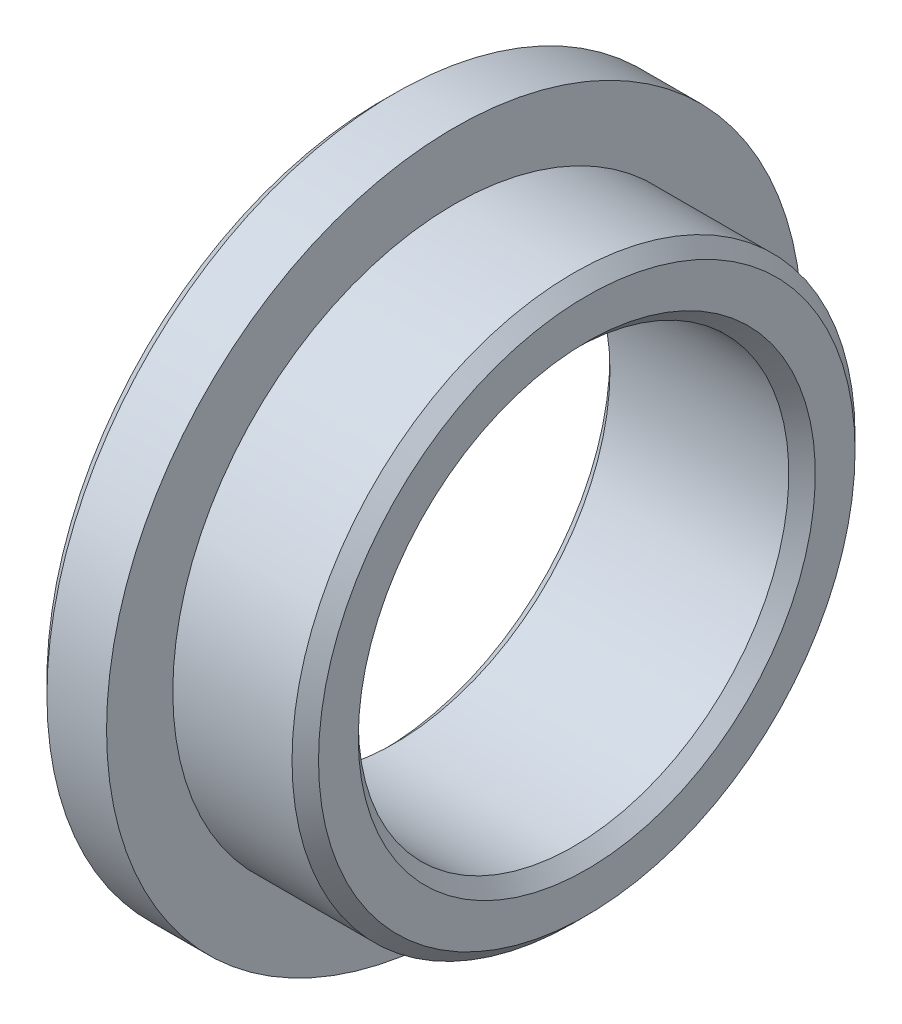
ISO-10303-21;
HEADER;
FILE_DESCRIPTION(('STEP AP214'),'2;1');
FILE_NAME('part.step','',(''),(''),'','','');
FILE_SCHEMA(('AUTOMOTIVE_DESIGN { 1 0 10303 214 1 1 1 1 }'));
ENDSEC;
DATA;
#1=APPLICATION_CONTEXT('core data for automotive mechanical design processes');
#2=APPLICATION_PROTOCOL_DEFINITION('international standard','automotive_design',2000,#1);
#3=PRODUCT_CONTEXT('',#1,'mechanical');
#4=PRODUCT('Part','Part','',(#3));
#5=PRODUCT_RELATED_PRODUCT_CATEGORY('part','',(#4));
#6=PRODUCT_DEFINITION_FORMATION('','',#4);
#7=PRODUCT_DEFINITION_CONTEXT('part definition',#1,'design');
#8=PRODUCT_DEFINITION('design','',#6,#7);
#9=PRODUCT_DEFINITION_SHAPE('','',#8);
#10=(LENGTH_UNIT() NAMED_UNIT(*) SI_UNIT(.MILLI.,.METRE.));
#11=(NAMED_UNIT(*) PLANE_ANGLE_UNIT() SI_UNIT($,.RADIAN.));
#12=(NAMED_UNIT(*) SI_UNIT($,.STERADIAN.) SOLID_ANGLE_UNIT());
#13=UNCERTAINTY_MEASURE_WITH_UNIT(LENGTH_MEASURE(1.E-05),#10,'distance_accuracy_value','');
#14=(GEOMETRIC_REPRESENTATION_CONTEXT(3) GLOBAL_UNCERTAINTY_ASSIGNED_CONTEXT((#13)) GLOBAL_UNIT_ASSIGNED_CONTEXT((#10,
#11,#12)) REPRESENTATION_CONTEXT('',''));
#15=CARTESIAN_POINT('',(0.,0.,0.));
#16=DIRECTION('',(0.,0.,1.));
#17=DIRECTION('',(1.,0.,0.));
#18=AXIS2_PLACEMENT_3D('',#15,#16,#17);
#19=CARTESIAN_POINT('',(0.,42.5,0.));
#20=DIRECTION('',(-1.,0.,0.));
#21=DIRECTION('',(0.,0.,1.));
#22=AXIS2_PLACEMENT_3D('',#19,#20,#21);
#23=PLANE('',#22);
#24=CARTESIAN_POINT('',(0.,0.,0.));
#25=DIRECTION('',(-1.,0.,0.));
#26=DIRECTION('',(0.,0.,1.));
#27=AXIS2_PLACEMENT_3D('',#24,#25,#26);
#28=CIRCLE('',#27,52.5);
#29=CARTESIAN_POINT('',(0.,0.,52.5));
#30=VERTEX_POINT('',#29);
#31=EDGE_CURVE('E63',#30,#30,#28,.T.);
#32=ORIENTED_EDGE('',*,*,#31,.F.);
#33=EDGE_LOOP('',(#32));
#34=FACE_BOUND('',#33,.T.);
#35=CARTESIAN_POINT('',(0.,0.,0.));
#36=DIRECTION('',(-1.,0.,0.));
#37=DIRECTION('',(0.,0.,1.));
#38=AXIS2_PLACEMENT_3D('',#35,#36,#37);
#39=CIRCLE('',#38,42.5);
#40=CARTESIAN_POINT('',(0.,0.,42.5));
#41=VERTEX_POINT('',#40);
#42=EDGE_CURVE('E60',#41,#41,#39,.T.);
#43=ORIENTED_EDGE('',*,*,#42,.T.);
#44=EDGE_LOOP('',(#43));
#45=FACE_BOUND('',#44,.T.);
#46=ADVANCED_FACE('F29',(#34,#45),#23,.F.);
#47=CARTESIAN_POINT('',(-17.7396825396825,0.,0.));
#48=DIRECTION('',(-1.,0.,0.));
#49=DIRECTION('',(0.,0.,1.));
#50=AXIS2_PLACEMENT_3D('',#47,#48,#49);
#51=CYLINDRICAL_SURFACE('',#50,42.5);
#52=CARTESIAN_POINT('',(18.,0.,0.));
#53=DIRECTION('',(-1.,0.,0.));
#54=DIRECTION('',(0.,0.,1.));
#55=AXIS2_PLACEMENT_3D('',#52,#53,#54);
#56=CIRCLE('',#55,42.5);
#57=CARTESIAN_POINT('',(18.,0.,42.5));
#58=VERTEX_POINT('',#57);
#59=EDGE_CURVE('E35',#58,#58,#56,.T.);
#60=ORIENTED_EDGE('',*,*,#59,.T.);
#61=EDGE_LOOP('',(#60));
#62=FACE_BOUND('',#61,.T.);
#63=ORIENTED_EDGE('',*,*,#42,.F.);
#64=EDGE_LOOP('',(#63));
#65=FACE_BOUND('',#64,.T.);
#66=ADVANCED_FACE('F71',(#62,#65),#51,.T.);
#67=CARTESIAN_POINT('',(20.,42.5,0.));
#68=DIRECTION('',(-1.,0.,0.));
#69=DIRECTION('',(0.,0.,1.));
#70=AXIS2_PLACEMENT_3D('',#67,#68,#69);
#71=PLANE('',#70);
#72=CARTESIAN_POINT('',(20.,0.,0.));
#73=DIRECTION('',(-1.,0.,0.));
#74=DIRECTION('',(0.,0.,1.));
#75=AXIS2_PLACEMENT_3D('',#72,#73,#74);
#76=CIRCLE('',#75,34.5);
#77=CARTESIAN_POINT('',(20.,0.,34.5));
#78=VERTEX_POINT('',#77);
#79=EDGE_CURVE('E54',#78,#78,#76,.T.);
#80=ORIENTED_EDGE('',*,*,#79,.T.);
#81=EDGE_LOOP('',(#80));
#82=FACE_BOUND('',#81,.T.);
#83=CARTESIAN_POINT('',(20.,0.,0.));
#84=DIRECTION('',(-1.,0.,0.));
#85=DIRECTION('',(0.,0.,1.));
#86=AXIS2_PLACEMENT_3D('',#83,#84,#85);
#87=CIRCLE('',#86,40.5);
#88=CARTESIAN_POINT('',(20.,0.,40.5));
#89=VERTEX_POINT('',#88);
#90=EDGE_CURVE('E57',#89,#89,#87,.F.);
#91=ORIENTED_EDGE('',*,*,#90,.T.);
#92=EDGE_LOOP('',(#91));
#93=FACE_BOUND('',#92,.T.);
#94=ADVANCED_FACE('F75',(#82,#93),#71,.F.);
#95=CARTESIAN_POINT('',(-17.7396825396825,0.,0.));
#96=DIRECTION('',(-1.,0.,0.));
#97=DIRECTION('',(0.,0.,1.));
#98=AXIS2_PLACEMENT_3D('',#95,#96,#97);
#99=CYLINDRICAL_SURFACE('',#98,32.5);
#100=CARTESIAN_POINT('',(18.,0.,0.));
#101=DIRECTION('',(-1.,0.,0.));
#102=DIRECTION('',(0.,0.,1.));
#103=AXIS2_PLACEMENT_3D('',#100,#101,#102);
#104=CIRCLE('',#103,32.5);
#105=CARTESIAN_POINT('',(18.,0.,32.5));
#106=VERTEX_POINT('',#105);
#107=EDGE_CURVE('E48',#106,#106,#104,.F.);
#108=ORIENTED_EDGE('',*,*,#107,.T.);
#109=EDGE_LOOP('',(#108));
#110=FACE_BOUND('',#109,.T.);
#111=CARTESIAN_POINT('',(-8.99999999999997,0.,0.));
#112=DIRECTION('',(1.,0.,0.));
#113=DIRECTION('',(0.,0.,-1.));
#114=AXIS2_PLACEMENT_3D('',#111,#112,#113);
#115=CIRCLE('',#114,32.5);
#116=CARTESIAN_POINT('',(-8.99999999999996,0.,-32.5));
#117=VERTEX_POINT('',#116);
#118=EDGE_CURVE('E51',#117,#117,#115,.F.);
#119=ORIENTED_EDGE('',*,*,#118,.T.);
#120=EDGE_LOOP('',(#119));
#121=FACE_BOUND('',#120,.T.);
#122=ADVANCED_FACE('F79',(#110,#121),#99,.F.);
#123=CARTESIAN_POINT('',(-11.,52.5,0.));
#124=DIRECTION('',(1.,0.,0.));
#125=DIRECTION('',(0.,0.,-1.));
#126=AXIS2_PLACEMENT_3D('',#123,#124,#125);
#127=PLANE('',#126);
#128=CARTESIAN_POINT('',(-11.,0.,0.));
#129=DIRECTION('',(1.,0.,0.));
#130=DIRECTION('',(0.,0.,-1.));
#131=AXIS2_PLACEMENT_3D('',#128,#129,#130);
#132=CIRCLE('',#131,34.5);
#133=CARTESIAN_POINT('',(-11.,0.,-34.5));
#134=VERTEX_POINT('',#133);
#135=EDGE_CURVE('E39',#134,#134,#132,.T.);
#136=ORIENTED_EDGE('',*,*,#135,.T.);
#137=EDGE_LOOP('',(#136));
#138=FACE_BOUND('',#137,.T.);
#139=CARTESIAN_POINT('',(-11.,0.,0.));
#140=DIRECTION('',(1.,0.,0.));
#141=DIRECTION('',(0.,0.,-1.));
#142=AXIS2_PLACEMENT_3D('',#139,#140,#141);
#143=CIRCLE('',#142,50.5);
#144=CARTESIAN_POINT('',(-11.,0.,-50.5));
#145=VERTEX_POINT('',#144);
#146=EDGE_CURVE('E43',#145,#145,#143,.F.);
#147=ORIENTED_EDGE('',*,*,#146,.T.);
#148=EDGE_LOOP('',(#147));
#149=FACE_BOUND('',#148,.T.);
#150=ADVANCED_FACE('F85',(#138,#149),#127,.F.);
#151=CARTESIAN_POINT('',(-17.7396825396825,0.,0.));
#152=DIRECTION('',(-1.,0.,0.));
#153=DIRECTION('',(0.,0.,1.));
#154=AXIS2_PLACEMENT_3D('',#151,#152,#153);
#155=CYLINDRICAL_SURFACE('',#154,52.5);
#156=CARTESIAN_POINT('',(-8.99999999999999,0.,0.));
#157=DIRECTION('',(1.,0.,0.));
#158=DIRECTION('',(0.,0.,-1.));
#159=AXIS2_PLACEMENT_3D('',#156,#157,#158);
#160=CIRCLE('',#159,52.5);
#161=CARTESIAN_POINT('',(-8.99999999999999,0.,-52.5));
#162=VERTEX_POINT('',#161);
#163=EDGE_CURVE('E10',#162,#162,#160,.T.);
#164=ORIENTED_EDGE('',*,*,#163,.T.);
#165=EDGE_LOOP('',(#164));
#166=FACE_BOUND('',#165,.T.);
#167=ORIENTED_EDGE('',*,*,#31,.T.);
#168=EDGE_LOOP('',(#167));
#169=FACE_BOUND('',#168,.T.);
#170=ADVANCED_FACE('F67',(#166,#169),#155,.T.);
#171=CARTESIAN_POINT('',(20.,0.,0.));
#172=DIRECTION('',(1.,0.,0.));
#173=DIRECTION('',(0.,0.,-1.));
#174=AXIS2_PLACEMENT_3D('',#171,#172,#173);
#175=CONICAL_SURFACE('',#174,34.5,0.785398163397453);
#176=ORIENTED_EDGE('',*,*,#107,.F.);
#177=EDGE_LOOP('',(#176));
#178=FACE_BOUND('',#177,.T.);
#179=ORIENTED_EDGE('',*,*,#79,.F.);
#180=EDGE_LOOP('',(#179));
#181=FACE_BOUND('',#180,.T.);
#182=ADVANCED_FACE('F92',(#178,#181),#175,.F.);
#183=CARTESIAN_POINT('',(-8.99999999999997,0.,0.));
#184=DIRECTION('',(-1.,0.,0.));
#185=DIRECTION('',(0.,0.,1.));
#186=AXIS2_PLACEMENT_3D('',#183,#184,#185);
#187=CONICAL_SURFACE('',#186,32.5,0.785398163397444);
#188=ORIENTED_EDGE('',*,*,#135,.F.);
#189=EDGE_LOOP('',(#188));
#190=FACE_BOUND('',#189,.T.);
#191=ORIENTED_EDGE('',*,*,#118,.F.);
#192=EDGE_LOOP('',(#191));
#193=FACE_BOUND('',#192,.T.);
#194=ADVANCED_FACE('F95',(#190,#193),#187,.F.);
#195=CARTESIAN_POINT('',(18.,0.,0.));
#196=DIRECTION('',(-1.,0.,0.));
#197=DIRECTION('',(0.,0.,1.));
#198=AXIS2_PLACEMENT_3D('',#195,#196,#197);
#199=CONICAL_SURFACE('',#198,42.5,0.785398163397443);
#200=ORIENTED_EDGE('',*,*,#90,.F.);
#201=EDGE_LOOP('',(#200));
#202=FACE_BOUND('',#201,.T.);
#203=ORIENTED_EDGE('',*,*,#59,.F.);
#204=EDGE_LOOP('',(#203));
#205=FACE_BOUND('',#204,.T.);
#206=ADVANCED_FACE('F99',(#202,#205),#199,.T.);
#207=CARTESIAN_POINT('',(-11.,0.,0.));
#208=DIRECTION('',(1.,0.,0.));
#209=DIRECTION('',(0.,0.,-1.));
#210=AXIS2_PLACEMENT_3D('',#207,#208,#209);
#211=CONICAL_SURFACE('',#210,50.5,0.785398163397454);
#212=ORIENTED_EDGE('',*,*,#163,.F.);
#213=EDGE_LOOP('',(#212));
#214=FACE_BOUND('',#213,.T.);
#215=ORIENTED_EDGE('',*,*,#146,.F.);
#216=EDGE_LOOP('',(#215));
#217=FACE_BOUND('',#216,.T.);
#218=ADVANCED_FACE('F103',(#214,#217),#211,.T.);
#219=CLOSED_SHELL('',(#46,#66,#94,#122,#150,#170,#182,#194,#206,#218));
#220=MANIFOLD_SOLID_BREP('B2',#219);
#221=ADVANCED_BREP_SHAPE_REPRESENTATION('',(#18,#220),#14);
#222=SHAPE_DEFINITION_REPRESENTATION(#9,#221);
ENDSEC;
END-ISO-10303-21;
